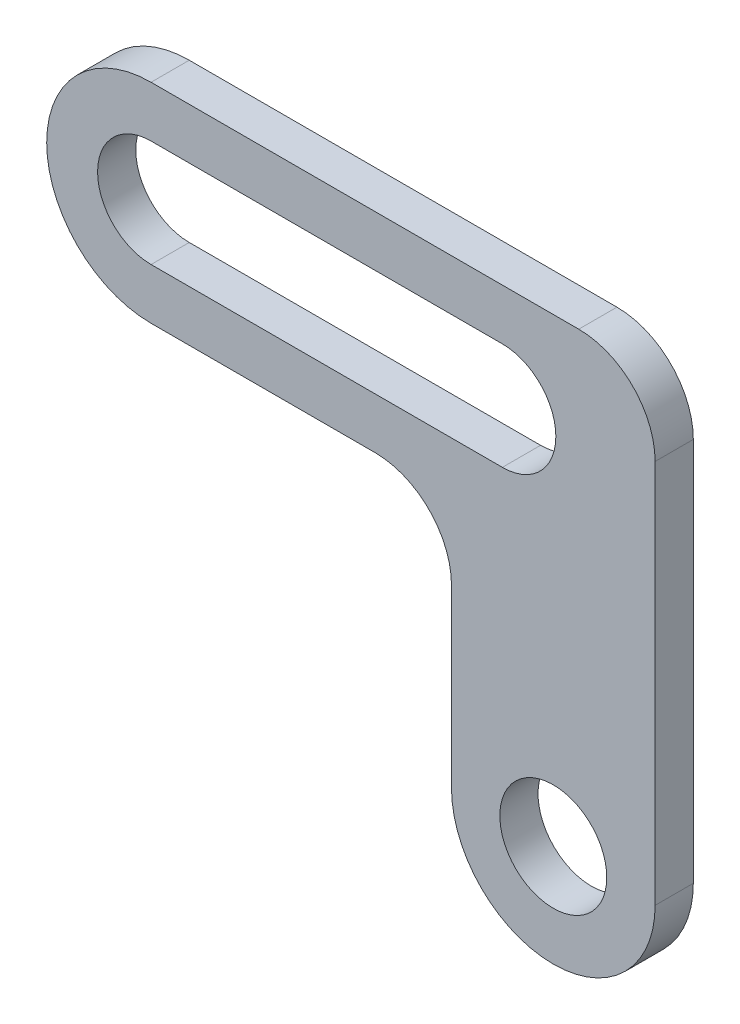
ISO-10303-21;
HEADER;
FILE_DESCRIPTION(('STEP AP214'),'2;1');
FILE_NAME('part.step','',(''),(''),'','','');
FILE_SCHEMA(('AUTOMOTIVE_DESIGN { 1 0 10303 214 1 1 1 1 }'));
ENDSEC;
DATA;
#1=APPLICATION_CONTEXT('core data for automotive mechanical design processes');
#2=APPLICATION_PROTOCOL_DEFINITION('international standard','automotive_design',2000,#1);
#3=PRODUCT_CONTEXT('',#1,'mechanical');
#4=PRODUCT('Part','Part','',(#3));
#5=PRODUCT_RELATED_PRODUCT_CATEGORY('part','',(#4));
#6=PRODUCT_DEFINITION_FORMATION('','',#4);
#7=PRODUCT_DEFINITION_CONTEXT('part definition',#1,'design');
#8=PRODUCT_DEFINITION('design','',#6,#7);
#9=PRODUCT_DEFINITION_SHAPE('','',#8);
#10=(LENGTH_UNIT() NAMED_UNIT(*) SI_UNIT(.MILLI.,.METRE.));
#11=(NAMED_UNIT(*) PLANE_ANGLE_UNIT() SI_UNIT($,.RADIAN.));
#12=(NAMED_UNIT(*) SI_UNIT($,.STERADIAN.) SOLID_ANGLE_UNIT());
#13=UNCERTAINTY_MEASURE_WITH_UNIT(LENGTH_MEASURE(1.E-05),#10,'distance_accuracy_value','');
#14=(GEOMETRIC_REPRESENTATION_CONTEXT(3) GLOBAL_UNCERTAINTY_ASSIGNED_CONTEXT((#13)) GLOBAL_UNIT_ASSIGNED_CONTEXT((#10,
#11,#12)) REPRESENTATION_CONTEXT('',''));
#15=CARTESIAN_POINT('',(0.,0.,0.));
#16=DIRECTION('',(0.,0.,1.));
#17=DIRECTION('',(1.,0.,0.));
#18=AXIS2_PLACEMENT_3D('',#15,#16,#17);
#19=CARTESIAN_POINT('',(0.,0.,15.));
#20=DIRECTION('',(0.,0.,1.));
#21=DIRECTION('',(1.,0.,0.));
#22=AXIS2_PLACEMENT_3D('',#19,#20,#21);
#23=PLANE('',#22);
#24=DIRECTION('',(1.,0.,0.));
#25=VECTOR('',#24,1.);
#26=CARTESIAN_POINT('',(-158.,119.,15.));
#27=LINE('',#26,#25);
#28=CARTESIAN_POINT('',(-158.,119.,15.));
#29=VERTEX_POINT('',#28);
#30=CARTESIAN_POINT('',(-20.,119.,15.));
#31=VERTEX_POINT('',#30);
#32=EDGE_CURVE('E132',#29,#31,#27,.T.);
#33=ORIENTED_EDGE('',*,*,#32,.F.);
#34=CARTESIAN_POINT('',(-158.,140.,15.));
#35=DIRECTION('',(0.,0.,1.));
#36=DIRECTION('',(1.,0.,0.));
#37=AXIS2_PLACEMENT_3D('',#34,#35,#36);
#38=CIRCLE('',#37,21.);
#39=CARTESIAN_POINT('',(-158.,161.,15.));
#40=VERTEX_POINT('',#39);
#41=EDGE_CURVE('E122',#40,#29,#38,.T.);
#42=ORIENTED_EDGE('',*,*,#41,.F.);
#43=DIRECTION('',(-1.,0.,0.));
#44=VECTOR('',#43,1.);
#45=CARTESIAN_POINT('',(-158.,161.,15.));
#46=LINE('',#45,#44);
#47=CARTESIAN_POINT('',(-20.,161.,15.));
#48=VERTEX_POINT('',#47);
#49=EDGE_CURVE('E148',#48,#40,#46,.T.);
#50=ORIENTED_EDGE('',*,*,#49,.F.);
#51=CARTESIAN_POINT('',(-20.,140.,15.));
#52=DIRECTION('',(0.,0.,1.));
#53=DIRECTION('',(1.,0.,0.));
#54=AXIS2_PLACEMENT_3D('',#51,#52,#53);
#55=CIRCLE('',#54,21.);
#56=EDGE_CURVE('E146',#31,#48,#55,.T.);
#57=ORIENTED_EDGE('',*,*,#56,.F.);
#58=EDGE_LOOP('',(#33,#42,#50,#57));
#59=FACE_BOUND('',#58,.T.);
#60=DIRECTION('',(0.,1.,0.));
#61=VECTOR('',#60,1.);
#62=CARTESIAN_POINT('',(40.,0.,15.));
#63=LINE('',#62,#61);
#64=CARTESIAN_POINT('',(40.,0.,15.));
#65=VERTEX_POINT('',#64);
#66=CARTESIAN_POINT('',(40.,151.,15.));
#67=VERTEX_POINT('',#66);
#68=EDGE_CURVE('E169',#65,#67,#63,.T.);
#69=ORIENTED_EDGE('',*,*,#68,.T.);
#70=CARTESIAN_POINT('',(10.,151.,15.));
#71=DIRECTION('',(0.,0.,1.));
#72=DIRECTION('',(1.,0.,0.));
#73=AXIS2_PLACEMENT_3D('',#70,#71,#72);
#74=CIRCLE('',#73,30.);
#75=CARTESIAN_POINT('',(10.,181.,15.));
#76=VERTEX_POINT('',#75);
#77=EDGE_CURVE('E215',#67,#76,#74,.T.);
#78=ORIENTED_EDGE('',*,*,#77,.T.);
#79=DIRECTION('',(-1.,0.,0.));
#80=VECTOR('',#79,1.);
#81=CARTESIAN_POINT('',(40.,181.,15.));
#82=LINE('',#81,#80);
#83=CARTESIAN_POINT('',(-158.,181.,15.));
#84=VERTEX_POINT('',#83);
#85=EDGE_CURVE('E172',#76,#84,#82,.T.);
#86=ORIENTED_EDGE('',*,*,#85,.T.);
#87=CARTESIAN_POINT('',(-158.,140.,15.));
#88=DIRECTION('',(0.,0.,1.));
#89=DIRECTION('',(1.,0.,0.));
#90=AXIS2_PLACEMENT_3D('',#87,#88,#89);
#91=CIRCLE('',#90,40.9999999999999);
#92=CARTESIAN_POINT('',(-158.,99.0000000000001,15.));
#93=VERTEX_POINT('',#92);
#94=EDGE_CURVE('E174',#84,#93,#91,.T.);
#95=ORIENTED_EDGE('',*,*,#94,.T.);
#96=DIRECTION('',(1.,0.,0.));
#97=VECTOR('',#96,1.);
#98=CARTESIAN_POINT('',(-158.,99.0000000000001,15.));
#99=LINE('',#98,#97);
#100=CARTESIAN_POINT('',(-70.,99.0000000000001,15.));
#101=VERTEX_POINT('',#100);
#102=EDGE_CURVE('E176',#93,#101,#99,.T.);
#103=ORIENTED_EDGE('',*,*,#102,.T.);
#104=CARTESIAN_POINT('',(-70.,69.0000000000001,15.));
#105=DIRECTION('',(0.,0.,1.));
#106=DIRECTION('',(1.,0.,0.));
#107=AXIS2_PLACEMENT_3D('',#104,#105,#106);
#108=CIRCLE('',#107,30.);
#109=CARTESIAN_POINT('',(-40.,69.0000000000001,15.));
#110=VERTEX_POINT('',#109);
#111=EDGE_CURVE('E11',#101,#110,#108,.F.);
#112=ORIENTED_EDGE('',*,*,#111,.T.);
#113=DIRECTION('',(0.,-1.,0.));
#114=VECTOR('',#113,1.);
#115=CARTESIAN_POINT('',(-40.,99.0000000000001,15.));
#116=LINE('',#115,#114);
#117=CARTESIAN_POINT('',(-40.,0.,15.));
#118=VERTEX_POINT('',#117);
#119=EDGE_CURVE('E179',#110,#118,#116,.T.);
#120=ORIENTED_EDGE('',*,*,#119,.T.);
#121=CARTESIAN_POINT('',(0.,0.,15.));
#122=DIRECTION('',(0.,0.,1.));
#123=DIRECTION('',(1.,0.,0.));
#124=AXIS2_PLACEMENT_3D('',#121,#122,#123);
#125=CIRCLE('',#124,40.);
#126=EDGE_CURVE('E166',#118,#65,#125,.T.);
#127=ORIENTED_EDGE('',*,*,#126,.T.);
#128=EDGE_LOOP('',(#69,#78,#86,#95,#103,#112,#120,#127));
#129=FACE_BOUND('',#128,.T.);
#130=CARTESIAN_POINT('',(0.,0.,15.));
#131=DIRECTION('',(0.,0.,1.));
#132=DIRECTION('',(1.,0.,0.));
#133=AXIS2_PLACEMENT_3D('',#130,#131,#132);
#134=CIRCLE('',#133,21.);
#135=CARTESIAN_POINT('',(21.,0.,15.));
#136=VERTEX_POINT('',#135);
#137=EDGE_CURVE('E155',#136,#136,#134,.T.);
#138=ORIENTED_EDGE('',*,*,#137,.F.);
#139=EDGE_LOOP('',(#138));
#140=FACE_BOUND('',#139,.T.);
#141=ADVANCED_FACE('F33',(#59,#129,#140),#23,.T.);
#142=CARTESIAN_POINT('',(0.,0.,0.));
#143=DIRECTION('',(0.,0.,1.));
#144=DIRECTION('',(1.,0.,0.));
#145=AXIS2_PLACEMENT_3D('',#142,#143,#144);
#146=PLANE('',#145);
#147=DIRECTION('',(-1.,0.,0.));
#148=VECTOR('',#147,1.);
#149=CARTESIAN_POINT('',(40.,181.,0.));
#150=LINE('',#149,#148);
#151=CARTESIAN_POINT('',(10.,181.,0.));
#152=VERTEX_POINT('',#151);
#153=CARTESIAN_POINT('',(-158.,181.,0.));
#154=VERTEX_POINT('',#153);
#155=EDGE_CURVE('E186',#152,#154,#150,.T.);
#156=ORIENTED_EDGE('',*,*,#155,.F.);
#157=CARTESIAN_POINT('',(10.,151.,0.));
#158=DIRECTION('',(0.,0.,1.));
#159=DIRECTION('',(1.,0.,0.));
#160=AXIS2_PLACEMENT_3D('',#157,#158,#159);
#161=CIRCLE('',#160,30.);
#162=CARTESIAN_POINT('',(40.,151.,0.));
#163=VERTEX_POINT('',#162);
#164=EDGE_CURVE('E56',#152,#163,#161,.F.);
#165=ORIENTED_EDGE('',*,*,#164,.T.);
#166=DIRECTION('',(0.,1.,0.));
#167=VECTOR('',#166,1.);
#168=CARTESIAN_POINT('',(40.,0.,0.));
#169=LINE('',#168,#167);
#170=CARTESIAN_POINT('',(40.,0.,0.));
#171=VERTEX_POINT('',#170);
#172=EDGE_CURVE('E184',#171,#163,#169,.T.);
#173=ORIENTED_EDGE('',*,*,#172,.F.);
#174=CARTESIAN_POINT('',(0.,0.,0.));
#175=DIRECTION('',(0.,0.,1.));
#176=DIRECTION('',(1.,0.,0.));
#177=AXIS2_PLACEMENT_3D('',#174,#175,#176);
#178=CIRCLE('',#177,40.);
#179=CARTESIAN_POINT('',(-40.,0.,0.));
#180=VERTEX_POINT('',#179);
#181=EDGE_CURVE('E140',#180,#171,#178,.T.);
#182=ORIENTED_EDGE('',*,*,#181,.F.);
#183=DIRECTION('',(0.,-1.,0.));
#184=VECTOR('',#183,1.);
#185=CARTESIAN_POINT('',(-40.,99.0000000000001,0.));
#186=LINE('',#185,#184);
#187=CARTESIAN_POINT('',(-40.,69.0000000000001,0.));
#188=VERTEX_POINT('',#187);
#189=EDGE_CURVE('E170',#188,#180,#186,.T.);
#190=ORIENTED_EDGE('',*,*,#189,.F.);
#191=CARTESIAN_POINT('',(-70.,69.0000000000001,0.));
#192=DIRECTION('',(0.,0.,1.));
#193=DIRECTION('',(1.,0.,0.));
#194=AXIS2_PLACEMENT_3D('',#191,#192,#193);
#195=CIRCLE('',#194,30.);
#196=CARTESIAN_POINT('',(-70.,99.0000000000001,0.));
#197=VERTEX_POINT('',#196);
#198=EDGE_CURVE('E41',#188,#197,#195,.T.);
#199=ORIENTED_EDGE('',*,*,#198,.T.);
#200=DIRECTION('',(1.,0.,0.));
#201=VECTOR('',#200,1.);
#202=CARTESIAN_POINT('',(-158.,99.0000000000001,0.));
#203=LINE('',#202,#201);
#204=CARTESIAN_POINT('',(-158.,99.0000000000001,0.));
#205=VERTEX_POINT('',#204);
#206=EDGE_CURVE('E190',#205,#197,#203,.T.);
#207=ORIENTED_EDGE('',*,*,#206,.F.);
#208=CARTESIAN_POINT('',(-158.,140.,0.));
#209=DIRECTION('',(0.,0.,1.));
#210=DIRECTION('',(1.,0.,0.));
#211=AXIS2_PLACEMENT_3D('',#208,#209,#210);
#212=CIRCLE('',#211,40.9999999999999);
#213=EDGE_CURVE('E188',#154,#205,#212,.T.);
#214=ORIENTED_EDGE('',*,*,#213,.F.);
#215=EDGE_LOOP('',(#156,#165,#173,#182,#190,#199,#207,#214));
#216=FACE_BOUND('',#215,.T.);
#217=CARTESIAN_POINT('',(-158.,140.,0.));
#218=DIRECTION('',(0.,0.,1.));
#219=DIRECTION('',(1.,0.,0.));
#220=AXIS2_PLACEMENT_3D('',#217,#218,#219);
#221=CIRCLE('',#220,21.);
#222=CARTESIAN_POINT('',(-158.,161.,0.));
#223=VERTEX_POINT('',#222);
#224=CARTESIAN_POINT('',(-158.,119.,0.));
#225=VERTEX_POINT('',#224);
#226=EDGE_CURVE('E153',#223,#225,#221,.T.);
#227=ORIENTED_EDGE('',*,*,#226,.T.);
#228=DIRECTION('',(1.,0.,0.));
#229=VECTOR('',#228,1.);
#230=CARTESIAN_POINT('',(-158.,119.,0.));
#231=LINE('',#230,#229);
#232=CARTESIAN_POINT('',(-20.,119.,0.));
#233=VERTEX_POINT('',#232);
#234=EDGE_CURVE('E139',#225,#233,#231,.T.);
#235=ORIENTED_EDGE('',*,*,#234,.T.);
#236=CARTESIAN_POINT('',(-20.,140.,0.));
#237=DIRECTION('',(0.,0.,1.));
#238=DIRECTION('',(1.,0.,0.));
#239=AXIS2_PLACEMENT_3D('',#236,#237,#238);
#240=CIRCLE('',#239,21.);
#241=CARTESIAN_POINT('',(-20.,161.,0.));
#242=VERTEX_POINT('',#241);
#243=EDGE_CURVE('E157',#233,#242,#240,.T.);
#244=ORIENTED_EDGE('',*,*,#243,.T.);
#245=DIRECTION('',(-1.,0.,0.));
#246=VECTOR('',#245,1.);
#247=CARTESIAN_POINT('',(-158.,161.,0.));
#248=LINE('',#247,#246);
#249=EDGE_CURVE('E133',#242,#223,#248,.T.);
#250=ORIENTED_EDGE('',*,*,#249,.T.);
#251=EDGE_LOOP('',(#227,#235,#244,#250));
#252=FACE_BOUND('',#251,.T.);
#253=CARTESIAN_POINT('',(0.,0.,0.));
#254=DIRECTION('',(0.,0.,1.));
#255=DIRECTION('',(1.,0.,0.));
#256=AXIS2_PLACEMENT_3D('',#253,#254,#255);
#257=CIRCLE('',#256,21.);
#258=CARTESIAN_POINT('',(21.,0.,0.));
#259=VERTEX_POINT('',#258);
#260=EDGE_CURVE('E297',#259,#259,#257,.T.);
#261=ORIENTED_EDGE('',*,*,#260,.T.);
#262=EDGE_LOOP('',(#261));
#263=FACE_BOUND('',#262,.T.);
#264=ADVANCED_FACE('F218',(#216,#252,#263),#146,.F.);
#265=CARTESIAN_POINT('',(0.,0.,15.));
#266=DIRECTION('',(0.,0.,-1.));
#267=DIRECTION('',(-1.,0.,0.));
#268=AXIS2_PLACEMENT_3D('',#265,#266,#267);
#269=CYLINDRICAL_SURFACE('',#268,40.);
#270=ORIENTED_EDGE('',*,*,#181,.T.);
#271=DIRECTION('',(0.,0.,-1.));
#272=VECTOR('',#271,1.);
#273=CARTESIAN_POINT('',(40.,0.,15.));
#274=LINE('',#273,#272);
#275=EDGE_CURVE('E202',#65,#171,#274,.T.);
#276=ORIENTED_EDGE('',*,*,#275,.F.);
#277=ORIENTED_EDGE('',*,*,#126,.F.);
#278=DIRECTION('',(0.,0.,-1.));
#279=VECTOR('',#278,1.);
#280=CARTESIAN_POINT('',(-40.,0.,15.));
#281=LINE('',#280,#279);
#282=EDGE_CURVE('E181',#118,#180,#281,.T.);
#283=ORIENTED_EDGE('',*,*,#282,.T.);
#284=EDGE_LOOP('',(#270,#276,#277,#283));
#285=FACE_BOUND('',#284,.T.);
#286=ADVANCED_FACE('F239',(#285),#269,.T.);
#287=CARTESIAN_POINT('',(40.,0.,15.));
#288=DIRECTION('',(-1.,0.,0.));
#289=DIRECTION('',(0.,-1.,0.));
#290=AXIS2_PLACEMENT_3D('',#287,#288,#289);
#291=PLANE('',#290);
#292=ORIENTED_EDGE('',*,*,#172,.T.);
#293=DIRECTION('',(0.,0.,-1.));
#294=VECTOR('',#293,1.);
#295=CARTESIAN_POINT('',(40.,151.,15.));
#296=LINE('',#295,#294);
#297=EDGE_CURVE('E48',#163,#67,#296,.F.);
#298=ORIENTED_EDGE('',*,*,#297,.T.);
#299=ORIENTED_EDGE('',*,*,#68,.F.);
#300=ORIENTED_EDGE('',*,*,#275,.T.);
#301=EDGE_LOOP('',(#292,#298,#299,#300));
#302=FACE_BOUND('',#301,.T.);
#303=ADVANCED_FACE('F257',(#302),#291,.F.);
#304=CARTESIAN_POINT('',(40.,181.,15.));
#305=DIRECTION('',(0.,-1.,0.));
#306=DIRECTION('',(1.,0.,0.));
#307=AXIS2_PLACEMENT_3D('',#304,#305,#306);
#308=PLANE('',#307);
#309=ORIENTED_EDGE('',*,*,#85,.F.);
#310=DIRECTION('',(0.,0.,-1.));
#311=VECTOR('',#310,1.);
#312=CARTESIAN_POINT('',(10.,181.,15.));
#313=LINE('',#312,#311);
#314=EDGE_CURVE('E210',#76,#152,#313,.T.);
#315=ORIENTED_EDGE('',*,*,#314,.T.);
#316=ORIENTED_EDGE('',*,*,#155,.T.);
#317=DIRECTION('',(0.,0.,-1.));
#318=VECTOR('',#317,1.);
#319=CARTESIAN_POINT('',(-158.,181.,15.));
#320=LINE('',#319,#318);
#321=EDGE_CURVE('E199',#84,#154,#320,.T.);
#322=ORIENTED_EDGE('',*,*,#321,.F.);
#323=EDGE_LOOP('',(#309,#315,#316,#322));
#324=FACE_BOUND('',#323,.T.);
#325=ADVANCED_FACE('F245',(#324),#308,.F.);
#326=CARTESIAN_POINT('',(-158.,140.,15.));
#327=DIRECTION('',(0.,0.,-1.));
#328=DIRECTION('',(-1.,0.,0.));
#329=AXIS2_PLACEMENT_3D('',#326,#327,#328);
#330=CYLINDRICAL_SURFACE('',#329,40.9999999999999);
#331=ORIENTED_EDGE('',*,*,#213,.T.);
#332=DIRECTION('',(0.,0.,-1.));
#333=VECTOR('',#332,1.);
#334=CARTESIAN_POINT('',(-158.,99.0000000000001,15.));
#335=LINE('',#334,#333);
#336=EDGE_CURVE('E196',#93,#205,#335,.T.);
#337=ORIENTED_EDGE('',*,*,#336,.F.);
#338=ORIENTED_EDGE('',*,*,#94,.F.);
#339=ORIENTED_EDGE('',*,*,#321,.T.);
#340=EDGE_LOOP('',(#331,#337,#338,#339));
#341=FACE_BOUND('',#340,.T.);
#342=ADVANCED_FACE('F248',(#341),#330,.T.);
#343=CARTESIAN_POINT('',(-158.,99.0000000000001,15.));
#344=DIRECTION('',(0.,1.,0.));
#345=DIRECTION('',(0.,0.,1.));
#346=AXIS2_PLACEMENT_3D('',#343,#344,#345);
#347=PLANE('',#346);
#348=ORIENTED_EDGE('',*,*,#206,.T.);
#349=DIRECTION('',(0.,0.,-1.));
#350=VECTOR('',#349,1.);
#351=CARTESIAN_POINT('',(-70.,99.0000000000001,15.));
#352=LINE('',#351,#350);
#353=EDGE_CURVE('E208',#197,#101,#352,.F.);
#354=ORIENTED_EDGE('',*,*,#353,.T.);
#355=ORIENTED_EDGE('',*,*,#102,.F.);
#356=ORIENTED_EDGE('',*,*,#336,.T.);
#357=EDGE_LOOP('',(#348,#354,#355,#356));
#358=FACE_BOUND('',#357,.T.);
#359=ADVANCED_FACE('F226',(#358),#347,.F.);
#360=CARTESIAN_POINT('',(-40.,99.0000000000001,15.));
#361=DIRECTION('',(1.,0.,0.));
#362=DIRECTION('',(0.,1.,0.));
#363=AXIS2_PLACEMENT_3D('',#360,#361,#362);
#364=PLANE('',#363);
#365=ORIENTED_EDGE('',*,*,#119,.F.);
#366=DIRECTION('',(0.,0.,-1.));
#367=VECTOR('',#366,1.);
#368=CARTESIAN_POINT('',(-40.,69.0000000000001,0.));
#369=LINE('',#368,#367);
#370=EDGE_CURVE('E205',#110,#188,#369,.T.);
#371=ORIENTED_EDGE('',*,*,#370,.T.);
#372=ORIENTED_EDGE('',*,*,#189,.T.);
#373=ORIENTED_EDGE('',*,*,#282,.F.);
#374=EDGE_LOOP('',(#365,#371,#372,#373));
#375=FACE_BOUND('',#374,.T.);
#376=ADVANCED_FACE('F235',(#375),#364,.F.);
#377=CARTESIAN_POINT('',(-158.,140.,15.));
#378=DIRECTION('',(0.,0.,-1.));
#379=DIRECTION('',(-1.,0.,0.));
#380=AXIS2_PLACEMENT_3D('',#377,#378,#379);
#381=CYLINDRICAL_SURFACE('',#380,21.);
#382=ORIENTED_EDGE('',*,*,#226,.F.);
#383=DIRECTION('',(0.,0.,-1.));
#384=VECTOR('',#383,1.);
#385=CARTESIAN_POINT('',(-158.,161.,15.));
#386=LINE('',#385,#384);
#387=EDGE_CURVE('E128',#40,#223,#386,.T.);
#388=ORIENTED_EDGE('',*,*,#387,.F.);
#389=ORIENTED_EDGE('',*,*,#41,.T.);
#390=DIRECTION('',(0.,0.,-1.));
#391=VECTOR('',#390,1.);
#392=CARTESIAN_POINT('',(-158.,119.,15.));
#393=LINE('',#392,#391);
#394=EDGE_CURVE('E125',#29,#225,#393,.T.);
#395=ORIENTED_EDGE('',*,*,#394,.T.);
#396=EDGE_LOOP('',(#382,#388,#389,#395));
#397=FACE_BOUND('',#396,.T.);
#398=ADVANCED_FACE('F124',(#397),#381,.F.);
#399=CARTESIAN_POINT('',(-158.,119.,15.));
#400=DIRECTION('',(0.,1.,0.));
#401=DIRECTION('',(0.,0.,1.));
#402=AXIS2_PLACEMENT_3D('',#399,#400,#401);
#403=PLANE('',#402);
#404=ORIENTED_EDGE('',*,*,#234,.F.);
#405=ORIENTED_EDGE('',*,*,#394,.F.);
#406=ORIENTED_EDGE('',*,*,#32,.T.);
#407=DIRECTION('',(0.,0.,-1.));
#408=VECTOR('',#407,1.);
#409=CARTESIAN_POINT('',(-20.,119.,15.));
#410=LINE('',#409,#408);
#411=EDGE_CURVE('E141',#31,#233,#410,.T.);
#412=ORIENTED_EDGE('',*,*,#411,.T.);
#413=EDGE_LOOP('',(#404,#405,#406,#412));
#414=FACE_BOUND('',#413,.T.);
#415=ADVANCED_FACE('F136',(#414),#403,.T.);
#416=CARTESIAN_POINT('',(-20.,140.,15.));
#417=DIRECTION('',(0.,0.,-1.));
#418=DIRECTION('',(-1.,0.,0.));
#419=AXIS2_PLACEMENT_3D('',#416,#417,#418);
#420=CYLINDRICAL_SURFACE('',#419,21.);
#421=ORIENTED_EDGE('',*,*,#243,.F.);
#422=ORIENTED_EDGE('',*,*,#411,.F.);
#423=ORIENTED_EDGE('',*,*,#56,.T.);
#424=DIRECTION('',(0.,0.,-1.));
#425=VECTOR('',#424,1.);
#426=CARTESIAN_POINT('',(-20.,161.,15.));
#427=LINE('',#426,#425);
#428=EDGE_CURVE('E163',#48,#242,#427,.T.);
#429=ORIENTED_EDGE('',*,*,#428,.T.);
#430=EDGE_LOOP('',(#421,#422,#423,#429));
#431=FACE_BOUND('',#430,.T.);
#432=ADVANCED_FACE('F275',(#431),#420,.F.);
#433=CARTESIAN_POINT('',(-158.,161.,15.));
#434=DIRECTION('',(0.,-1.,0.));
#435=DIRECTION('',(0.,0.,-1.));
#436=AXIS2_PLACEMENT_3D('',#433,#434,#435);
#437=PLANE('',#436);
#438=ORIENTED_EDGE('',*,*,#249,.F.);
#439=ORIENTED_EDGE('',*,*,#428,.F.);
#440=ORIENTED_EDGE('',*,*,#49,.T.);
#441=ORIENTED_EDGE('',*,*,#387,.T.);
#442=EDGE_LOOP('',(#438,#439,#440,#441));
#443=FACE_BOUND('',#442,.T.);
#444=ADVANCED_FACE('F279',(#443),#437,.T.);
#445=CARTESIAN_POINT('',(0.,0.,15.));
#446=DIRECTION('',(0.,0.,-1.));
#447=DIRECTION('',(-1.,0.,0.));
#448=AXIS2_PLACEMENT_3D('',#445,#446,#447);
#449=CYLINDRICAL_SURFACE('',#448,21.);
#450=ORIENTED_EDGE('',*,*,#137,.T.);
#451=EDGE_LOOP('',(#450));
#452=FACE_BOUND('',#451,.T.);
#453=ORIENTED_EDGE('',*,*,#260,.F.);
#454=EDGE_LOOP('',(#453));
#455=FACE_BOUND('',#454,.T.);
#456=ADVANCED_FACE('F285',(#452,#455),#449,.F.);
#457=CARTESIAN_POINT('',(-70.,69.0000000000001,15.));
#458=DIRECTION('',(0.,0.,1.));
#459=DIRECTION('',(1.,0.,0.));
#460=AXIS2_PLACEMENT_3D('',#457,#458,#459);
#461=CYLINDRICAL_SURFACE('',#460,30.);
#462=ORIENTED_EDGE('',*,*,#111,.F.);
#463=ORIENTED_EDGE('',*,*,#353,.F.);
#464=ORIENTED_EDGE('',*,*,#198,.F.);
#465=ORIENTED_EDGE('',*,*,#370,.F.);
#466=EDGE_LOOP('',(#462,#463,#464,#465));
#467=FACE_BOUND('',#466,.T.);
#468=ADVANCED_FACE('F230',(#467),#461,.F.);
#469=CARTESIAN_POINT('',(10.,151.,15.));
#470=DIRECTION('',(0.,0.,-1.));
#471=DIRECTION('',(-1.,0.,0.));
#472=AXIS2_PLACEMENT_3D('',#469,#470,#471);
#473=CYLINDRICAL_SURFACE('',#472,30.);
#474=ORIENTED_EDGE('',*,*,#77,.F.);
#475=ORIENTED_EDGE('',*,*,#297,.F.);
#476=ORIENTED_EDGE('',*,*,#164,.F.);
#477=ORIENTED_EDGE('',*,*,#314,.F.);
#478=EDGE_LOOP('',(#474,#475,#476,#477));
#479=FACE_BOUND('',#478,.T.);
#480=ADVANCED_FACE('F35',(#479),#473,.T.);
#481=CLOSED_SHELL('',(#141,#264,#286,#303,#325,#342,#359,#376,#398,#415,#432,#444,#456,#468,#480));
#482=MANIFOLD_SOLID_BREP('B2',#481);
#483=ADVANCED_BREP_SHAPE_REPRESENTATION('',(#18,#482),#14);
#484=SHAPE_DEFINITION_REPRESENTATION(#9,#483);
ENDSEC;
END-ISO-10303-21;
